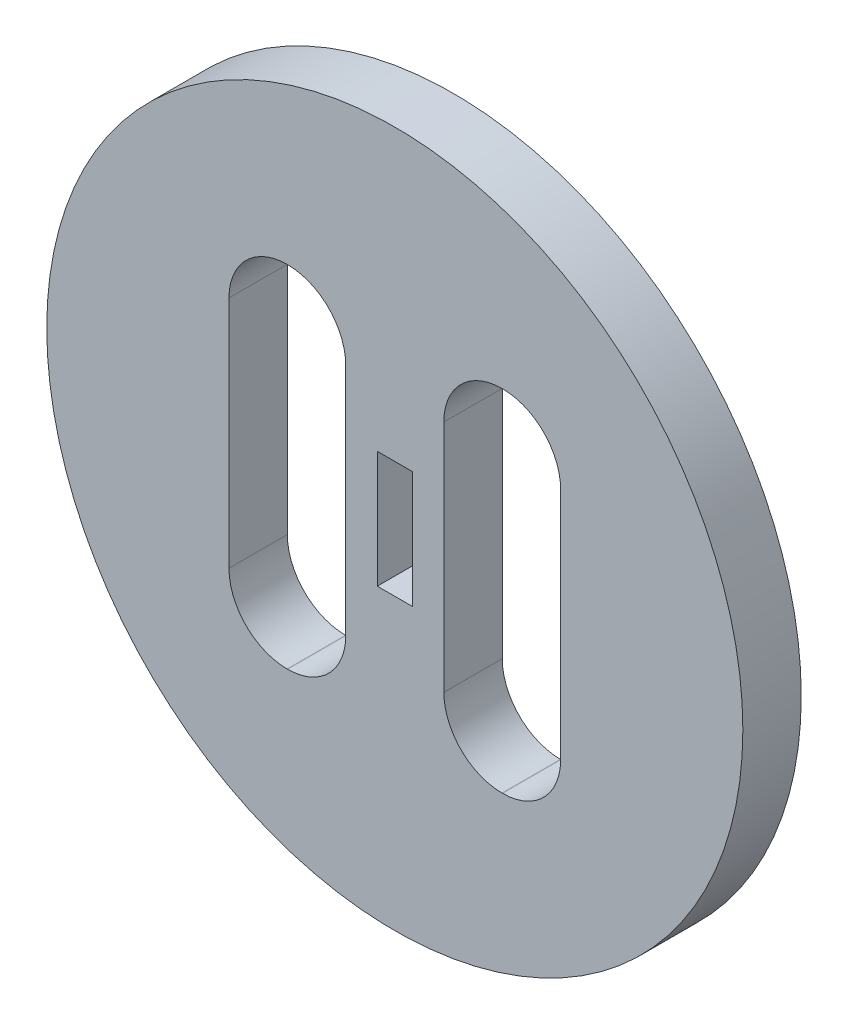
ISO-10303-21;
HEADER;
FILE_DESCRIPTION(('STEP AP214'),'2;1');
FILE_NAME('part.step','',(''),(''),'','','');
FILE_SCHEMA(('AUTOMOTIVE_DESIGN { 1 0 10303 214 1 1 1 1 }'));
ENDSEC;
DATA;
#1=APPLICATION_CONTEXT('core data for automotive mechanical design processes');
#2=APPLICATION_PROTOCOL_DEFINITION('international standard','automotive_design',2000,#1);
#3=PRODUCT_CONTEXT('',#1,'mechanical');
#4=PRODUCT('Part','Part','',(#3));
#5=PRODUCT_RELATED_PRODUCT_CATEGORY('part','',(#4));
#6=PRODUCT_DEFINITION_FORMATION('','',#4);
#7=PRODUCT_DEFINITION_CONTEXT('part definition',#1,'design');
#8=PRODUCT_DEFINITION('design','',#6,#7);
#9=PRODUCT_DEFINITION_SHAPE('','',#8);
#10=(LENGTH_UNIT() NAMED_UNIT(*) SI_UNIT(.MILLI.,.METRE.));
#11=(NAMED_UNIT(*) PLANE_ANGLE_UNIT() SI_UNIT($,.RADIAN.));
#12=(NAMED_UNIT(*) SI_UNIT($,.STERADIAN.) SOLID_ANGLE_UNIT());
#13=UNCERTAINTY_MEASURE_WITH_UNIT(LENGTH_MEASURE(1.E-05),#10,'distance_accuracy_value','');
#14=(GEOMETRIC_REPRESENTATION_CONTEXT(3) GLOBAL_UNCERTAINTY_ASSIGNED_CONTEXT((#13)) GLOBAL_UNIT_ASSIGNED_CONTEXT((#10,
#11,#12)) REPRESENTATION_CONTEXT('',''));
#15=CARTESIAN_POINT('',(0.,0.,0.));
#16=DIRECTION('',(0.,0.,1.));
#17=DIRECTION('',(1.,0.,0.));
#18=AXIS2_PLACEMENT_3D('',#15,#16,#17);
#19=CARTESIAN_POINT('',(0.,0.,6.35));
#20=DIRECTION('',(0.,0.,1.));
#21=DIRECTION('',(1.,0.,0.));
#22=AXIS2_PLACEMENT_3D('',#19,#20,#21);
#23=PLANE('',#22);
#24=DIRECTION('',(0.,-1.,0.));
#25=VECTOR('',#24,1.);
#26=CARTESIAN_POINT('',(5.334,12.7254,6.35));
#27=LINE('',#26,#25);
#28=CARTESIAN_POINT('',(5.334,12.7254,6.35));
#29=VERTEX_POINT('',#28);
#30=CARTESIAN_POINT('',(5.334,-12.7254,6.35));
#31=VERTEX_POINT('',#30);
#32=EDGE_CURVE('E229',#29,#31,#27,.T.);
#33=ORIENTED_EDGE('',*,*,#32,.F.);
#34=CARTESIAN_POINT('',(11.6586,12.7254,6.35));
#35=DIRECTION('',(0.,0.,1.));
#36=DIRECTION('',(-1.,0.,0.));
#37=AXIS2_PLACEMENT_3D('',#34,#35,#36);
#38=CIRCLE('',#37,6.3246);
#39=CARTESIAN_POINT('',(11.6586,19.05,6.35));
#40=VERTEX_POINT('',#39);
#41=EDGE_CURVE('E227',#40,#29,#38,.T.);
#42=ORIENTED_EDGE('',*,*,#41,.F.);
#43=DIRECTION('',(-1.,0.,0.));
#44=VECTOR('',#43,1.);
#45=CARTESIAN_POINT('',(11.6586,19.05,6.35));
#46=LINE('',#45,#44);
#47=CARTESIAN_POINT('',(11.7094,19.05,6.35));
#48=VERTEX_POINT('',#47);
#49=EDGE_CURVE('E242',#48,#40,#46,.T.);
#50=ORIENTED_EDGE('',*,*,#49,.F.);
#51=CARTESIAN_POINT('',(11.7094,12.7254,6.35));
#52=DIRECTION('',(0.,0.,1.));
#53=DIRECTION('',(1.,0.,0.));
#54=AXIS2_PLACEMENT_3D('',#51,#52,#53);
#55=CIRCLE('',#54,6.3246);
#56=CARTESIAN_POINT('',(18.034,12.7254,6.35));
#57=VERTEX_POINT('',#56);
#58=EDGE_CURVE('E239',#57,#48,#55,.T.);
#59=ORIENTED_EDGE('',*,*,#58,.F.);
#60=DIRECTION('',(0.,1.,0.));
#61=VECTOR('',#60,1.);
#62=CARTESIAN_POINT('',(18.034,12.7254,6.35));
#63=LINE('',#62,#61);
#64=CARTESIAN_POINT('',(18.034,-12.7254,6.35));
#65=VERTEX_POINT('',#64);
#66=EDGE_CURVE('E237',#65,#57,#63,.T.);
#67=ORIENTED_EDGE('',*,*,#66,.F.);
#68=CARTESIAN_POINT('',(11.7094,-12.7254,6.35));
#69=DIRECTION('',(0.,0.,1.));
#70=DIRECTION('',(1.,0.,0.));
#71=AXIS2_PLACEMENT_3D('',#68,#69,#70);
#72=CIRCLE('',#71,6.3246);
#73=CARTESIAN_POINT('',(11.7094,-19.05,6.35));
#74=VERTEX_POINT('',#73);
#75=EDGE_CURVE('E235',#74,#65,#72,.T.);
#76=ORIENTED_EDGE('',*,*,#75,.F.);
#77=DIRECTION('',(1.,0.,0.));
#78=VECTOR('',#77,1.);
#79=CARTESIAN_POINT('',(11.6586,-19.05,6.35));
#80=LINE('',#79,#78);
#81=CARTESIAN_POINT('',(11.6586,-19.05,6.35));
#82=VERTEX_POINT('',#81);
#83=EDGE_CURVE('E233',#82,#74,#80,.T.);
#84=ORIENTED_EDGE('',*,*,#83,.F.);
#85=CARTESIAN_POINT('',(11.6586,-12.7254,6.35));
#86=DIRECTION('',(0.,0.,1.));
#87=DIRECTION('',(1.,0.,0.));
#88=AXIS2_PLACEMENT_3D('',#85,#86,#87);
#89=CIRCLE('',#88,6.3246);
#90=EDGE_CURVE('E231',#31,#82,#89,.T.);
#91=ORIENTED_EDGE('',*,*,#90,.F.);
#92=EDGE_LOOP('',(#33,#42,#50,#59,#67,#76,#84,#91));
#93=FACE_BOUND('',#92,.T.);
#94=CARTESIAN_POINT('',(0.,0.,6.35));
#95=DIRECTION('',(0.,0.,1.));
#96=DIRECTION('',(1.,0.,0.));
#97=AXIS2_PLACEMENT_3D('',#94,#95,#96);
#98=CIRCLE('',#97,37.846);
#99=CARTESIAN_POINT('',(37.846,0.,6.35));
#100=VERTEX_POINT('',#99);
#101=EDGE_CURVE('E11',#100,#100,#98,.T.);
#102=ORIENTED_EDGE('',*,*,#101,.T.);
#103=EDGE_LOOP('',(#102));
#104=FACE_BOUND('',#103,.T.);
#105=DIRECTION('',(0.,-1.,0.));
#106=VECTOR('',#105,1.);
#107=CARTESIAN_POINT('',(-18.034,12.7254,6.35));
#108=LINE('',#107,#106);
#109=CARTESIAN_POINT('',(-18.034,12.7254,6.35));
#110=VERTEX_POINT('',#109);
#111=CARTESIAN_POINT('',(-18.034,-12.7254,6.35));
#112=VERTEX_POINT('',#111);
#113=EDGE_CURVE('E288',#110,#112,#108,.T.);
#114=ORIENTED_EDGE('',*,*,#113,.F.);
#115=CARTESIAN_POINT('',(-11.7094,12.7254,6.35));
#116=DIRECTION('',(0.,0.,1.));
#117=DIRECTION('',(-1.,0.,0.));
#118=AXIS2_PLACEMENT_3D('',#115,#116,#117);
#119=CIRCLE('',#118,6.3246);
#120=CARTESIAN_POINT('',(-11.7094,19.05,6.35));
#121=VERTEX_POINT('',#120);
#122=EDGE_CURVE('E286',#121,#110,#119,.T.);
#123=ORIENTED_EDGE('',*,*,#122,.F.);
#124=DIRECTION('',(-1.,0.,0.));
#125=VECTOR('',#124,1.);
#126=CARTESIAN_POINT('',(-11.7094,19.05,6.35));
#127=LINE('',#126,#125);
#128=CARTESIAN_POINT('',(-11.6586,19.05,6.35));
#129=VERTEX_POINT('',#128);
#130=EDGE_CURVE('E301',#129,#121,#127,.T.);
#131=ORIENTED_EDGE('',*,*,#130,.F.);
#132=CARTESIAN_POINT('',(-11.6586,12.7254,6.35));
#133=DIRECTION('',(0.,0.,1.));
#134=DIRECTION('',(1.,0.,0.));
#135=AXIS2_PLACEMENT_3D('',#132,#133,#134);
#136=CIRCLE('',#135,6.3246);
#137=CARTESIAN_POINT('',(-5.334,12.7254,6.35));
#138=VERTEX_POINT('',#137);
#139=EDGE_CURVE('E298',#138,#129,#136,.T.);
#140=ORIENTED_EDGE('',*,*,#139,.F.);
#141=DIRECTION('',(0.,1.,0.));
#142=VECTOR('',#141,1.);
#143=CARTESIAN_POINT('',(-5.334,12.7254,6.35));
#144=LINE('',#143,#142);
#145=CARTESIAN_POINT('',(-5.334,-12.7254,6.35));
#146=VERTEX_POINT('',#145);
#147=EDGE_CURVE('E296',#146,#138,#144,.T.);
#148=ORIENTED_EDGE('',*,*,#147,.F.);
#149=CARTESIAN_POINT('',(-11.6586,-12.7254,6.35));
#150=DIRECTION('',(0.,0.,1.));
#151=DIRECTION('',(1.,0.,0.));
#152=AXIS2_PLACEMENT_3D('',#149,#150,#151);
#153=CIRCLE('',#152,6.3246);
#154=CARTESIAN_POINT('',(-11.6586,-19.05,6.35));
#155=VERTEX_POINT('',#154);
#156=EDGE_CURVE('E294',#155,#146,#153,.T.);
#157=ORIENTED_EDGE('',*,*,#156,.F.);
#158=DIRECTION('',(1.,0.,0.));
#159=VECTOR('',#158,1.);
#160=CARTESIAN_POINT('',(-11.7094,-19.05,6.35));
#161=LINE('',#160,#159);
#162=CARTESIAN_POINT('',(-11.7094,-19.05,6.35));
#163=VERTEX_POINT('',#162);
#164=EDGE_CURVE('E292',#163,#155,#161,.T.);
#165=ORIENTED_EDGE('',*,*,#164,.F.);
#166=CARTESIAN_POINT('',(-11.7094,-12.7254,6.35));
#167=DIRECTION('',(0.,0.,1.));
#168=DIRECTION('',(-1.,0.,0.));
#169=AXIS2_PLACEMENT_3D('',#166,#167,#168);
#170=CIRCLE('',#169,6.3246);
#171=EDGE_CURVE('E290',#112,#163,#170,.T.);
#172=ORIENTED_EDGE('',*,*,#171,.F.);
#173=EDGE_LOOP('',(#114,#123,#131,#140,#148,#157,#165,#172));
#174=FACE_BOUND('',#173,.T.);
#175=DIRECTION('',(1.,0.,0.));
#176=VECTOR('',#175,1.);
#177=CARTESIAN_POINT('',(-1.905,-6.35,6.35));
#178=LINE('',#177,#176);
#179=CARTESIAN_POINT('',(-1.905,-6.35,6.35));
#180=VERTEX_POINT('',#179);
#181=CARTESIAN_POINT('',(1.905,-6.35,6.35));
#182=VERTEX_POINT('',#181);
#183=EDGE_CURVE('E194',#180,#182,#178,.T.);
#184=ORIENTED_EDGE('',*,*,#183,.F.);
#185=DIRECTION('',(0.,-1.,0.));
#186=VECTOR('',#185,1.);
#187=CARTESIAN_POINT('',(-1.905,6.35,6.35));
#188=LINE('',#187,#186);
#189=CARTESIAN_POINT('',(-1.905,6.35,6.35));
#190=VERTEX_POINT('',#189);
#191=EDGE_CURVE('E183',#190,#180,#188,.T.);
#192=ORIENTED_EDGE('',*,*,#191,.F.);
#193=DIRECTION('',(-1.,0.,0.));
#194=VECTOR('',#193,1.);
#195=CARTESIAN_POINT('',(-1.905,6.35,6.35));
#196=LINE('',#195,#194);
#197=CARTESIAN_POINT('',(1.905,6.35,6.35));
#198=VERTEX_POINT('',#197);
#199=EDGE_CURVE('E198',#198,#190,#196,.T.);
#200=ORIENTED_EDGE('',*,*,#199,.F.);
#201=DIRECTION('',(0.,1.,0.));
#202=VECTOR('',#201,1.);
#203=CARTESIAN_POINT('',(1.905,6.35,6.35));
#204=LINE('',#203,#202);
#205=EDGE_CURVE('E196',#182,#198,#204,.T.);
#206=ORIENTED_EDGE('',*,*,#205,.F.);
#207=EDGE_LOOP('',(#184,#192,#200,#206));
#208=FACE_BOUND('',#207,.T.);
#209=ADVANCED_FACE('F31',(#93,#104,#174,#208),#23,.T.);
#210=CARTESIAN_POINT('',(0.,0.,0.));
#211=DIRECTION('',(0.,0.,1.));
#212=DIRECTION('',(1.,0.,0.));
#213=AXIS2_PLACEMENT_3D('',#210,#211,#212);
#214=PLANE('',#213);
#215=CARTESIAN_POINT('',(11.6586,12.7254,0.));
#216=DIRECTION('',(0.,0.,1.));
#217=DIRECTION('',(-1.,0.,0.));
#218=AXIS2_PLACEMENT_3D('',#215,#216,#217);
#219=CIRCLE('',#218,6.3246);
#220=CARTESIAN_POINT('',(11.6586,19.05,0.));
#221=VERTEX_POINT('',#220);
#222=CARTESIAN_POINT('',(5.334,12.7254,0.));
#223=VERTEX_POINT('',#222);
#224=EDGE_CURVE('E184',#221,#223,#219,.T.);
#225=ORIENTED_EDGE('',*,*,#224,.T.);
#226=DIRECTION('',(0.,-1.,0.));
#227=VECTOR('',#226,1.);
#228=CARTESIAN_POINT('',(5.334,12.7254,0.));
#229=LINE('',#228,#227);
#230=CARTESIAN_POINT('',(5.334,-12.7254,0.));
#231=VERTEX_POINT('',#230);
#232=EDGE_CURVE('E206',#223,#231,#229,.T.);
#233=ORIENTED_EDGE('',*,*,#232,.T.);
#234=CARTESIAN_POINT('',(11.6586,-12.7254,0.));
#235=DIRECTION('',(0.,0.,1.));
#236=DIRECTION('',(1.,0.,0.));
#237=AXIS2_PLACEMENT_3D('',#234,#235,#236);
#238=CIRCLE('',#237,6.3246);
#239=CARTESIAN_POINT('',(11.6586,-19.05,0.));
#240=VERTEX_POINT('',#239);
#241=EDGE_CURVE('E209',#231,#240,#238,.T.);
#242=ORIENTED_EDGE('',*,*,#241,.T.);
#243=DIRECTION('',(1.,0.,0.));
#244=VECTOR('',#243,1.);
#245=CARTESIAN_POINT('',(11.6586,-19.05,0.));
#246=LINE('',#245,#244);
#247=CARTESIAN_POINT('',(11.7094,-19.05,0.));
#248=VERTEX_POINT('',#247);
#249=EDGE_CURVE('E212',#240,#248,#246,.T.);
#250=ORIENTED_EDGE('',*,*,#249,.T.);
#251=CARTESIAN_POINT('',(11.7094,-12.7254,0.));
#252=DIRECTION('',(0.,0.,1.));
#253=DIRECTION('',(1.,0.,0.));
#254=AXIS2_PLACEMENT_3D('',#251,#252,#253);
#255=CIRCLE('',#254,6.3246);
#256=CARTESIAN_POINT('',(18.034,-12.7254,0.));
#257=VERTEX_POINT('',#256);
#258=EDGE_CURVE('E215',#248,#257,#255,.T.);
#259=ORIENTED_EDGE('',*,*,#258,.T.);
#260=DIRECTION('',(0.,1.,0.));
#261=VECTOR('',#260,1.);
#262=CARTESIAN_POINT('',(18.034,12.7254,0.));
#263=LINE('',#262,#261);
#264=CARTESIAN_POINT('',(18.034,12.7254,0.));
#265=VERTEX_POINT('',#264);
#266=EDGE_CURVE('E218',#257,#265,#263,.T.);
#267=ORIENTED_EDGE('',*,*,#266,.T.);
#268=CARTESIAN_POINT('',(11.7094,12.7254,0.));
#269=DIRECTION('',(0.,0.,1.));
#270=DIRECTION('',(1.,0.,0.));
#271=AXIS2_PLACEMENT_3D('',#268,#269,#270);
#272=CIRCLE('',#271,6.3246);
#273=CARTESIAN_POINT('',(11.7094,19.05,0.));
#274=VERTEX_POINT('',#273);
#275=EDGE_CURVE('E221',#265,#274,#272,.T.);
#276=ORIENTED_EDGE('',*,*,#275,.T.);
#277=DIRECTION('',(-1.,0.,0.));
#278=VECTOR('',#277,1.);
#279=CARTESIAN_POINT('',(11.6586,19.05,0.));
#280=LINE('',#279,#278);
#281=EDGE_CURVE('E224',#274,#221,#280,.T.);
#282=ORIENTED_EDGE('',*,*,#281,.T.);
#283=EDGE_LOOP('',(#225,#233,#242,#250,#259,#267,#276,#282));
#284=FACE_BOUND('',#283,.T.);
#285=CARTESIAN_POINT('',(0.,0.,0.));
#286=DIRECTION('',(0.,0.,1.));
#287=DIRECTION('',(1.,0.,0.));
#288=AXIS2_PLACEMENT_3D('',#285,#286,#287);
#289=CIRCLE('',#288,37.846);
#290=CARTESIAN_POINT('',(37.846,0.,0.));
#291=VERTEX_POINT('',#290);
#292=EDGE_CURVE('E39',#291,#291,#289,.T.);
#293=ORIENTED_EDGE('',*,*,#292,.F.);
#294=EDGE_LOOP('',(#293));
#295=FACE_BOUND('',#294,.T.);
#296=CARTESIAN_POINT('',(-11.7094,12.7254,0.));
#297=DIRECTION('',(0.,0.,1.));
#298=DIRECTION('',(-1.,0.,0.));
#299=AXIS2_PLACEMENT_3D('',#296,#297,#298);
#300=CIRCLE('',#299,6.3246);
#301=CARTESIAN_POINT('',(-11.7094,19.05,0.));
#302=VERTEX_POINT('',#301);
#303=CARTESIAN_POINT('',(-18.034,12.7254,0.));
#304=VERTEX_POINT('',#303);
#305=EDGE_CURVE('E262',#302,#304,#300,.T.);
#306=ORIENTED_EDGE('',*,*,#305,.T.);
#307=DIRECTION('',(0.,-1.,0.));
#308=VECTOR('',#307,1.);
#309=CARTESIAN_POINT('',(-18.034,12.7254,0.));
#310=LINE('',#309,#308);
#311=CARTESIAN_POINT('',(-18.034,-12.7254,0.));
#312=VERTEX_POINT('',#311);
#313=EDGE_CURVE('E265',#304,#312,#310,.T.);
#314=ORIENTED_EDGE('',*,*,#313,.T.);
#315=CARTESIAN_POINT('',(-11.7094,-12.7254,0.));
#316=DIRECTION('',(0.,0.,1.));
#317=DIRECTION('',(-1.,0.,0.));
#318=AXIS2_PLACEMENT_3D('',#315,#316,#317);
#319=CIRCLE('',#318,6.3246);
#320=CARTESIAN_POINT('',(-11.7094,-19.05,0.));
#321=VERTEX_POINT('',#320);
#322=EDGE_CURVE('E268',#312,#321,#319,.T.);
#323=ORIENTED_EDGE('',*,*,#322,.T.);
#324=DIRECTION('',(1.,0.,0.));
#325=VECTOR('',#324,1.);
#326=CARTESIAN_POINT('',(-11.7094,-19.05,0.));
#327=LINE('',#326,#325);
#328=CARTESIAN_POINT('',(-11.6586,-19.05,0.));
#329=VERTEX_POINT('',#328);
#330=EDGE_CURVE('E271',#321,#329,#327,.T.);
#331=ORIENTED_EDGE('',*,*,#330,.T.);
#332=CARTESIAN_POINT('',(-11.6586,-12.7254,0.));
#333=DIRECTION('',(0.,0.,1.));
#334=DIRECTION('',(1.,0.,0.));
#335=AXIS2_PLACEMENT_3D('',#332,#333,#334);
#336=CIRCLE('',#335,6.3246);
#337=CARTESIAN_POINT('',(-5.334,-12.7254,0.));
#338=VERTEX_POINT('',#337);
#339=EDGE_CURVE('E274',#329,#338,#336,.T.);
#340=ORIENTED_EDGE('',*,*,#339,.T.);
#341=DIRECTION('',(0.,1.,0.));
#342=VECTOR('',#341,1.);
#343=CARTESIAN_POINT('',(-5.334,12.7254,0.));
#344=LINE('',#343,#342);
#345=CARTESIAN_POINT('',(-5.334,12.7254,0.));
#346=VERTEX_POINT('',#345);
#347=EDGE_CURVE('E277',#338,#346,#344,.T.);
#348=ORIENTED_EDGE('',*,*,#347,.T.);
#349=CARTESIAN_POINT('',(-11.6586,12.7254,0.));
#350=DIRECTION('',(0.,0.,1.));
#351=DIRECTION('',(1.,0.,0.));
#352=AXIS2_PLACEMENT_3D('',#349,#350,#351);
#353=CIRCLE('',#352,6.3246);
#354=CARTESIAN_POINT('',(-11.6586,19.05,0.));
#355=VERTEX_POINT('',#354);
#356=EDGE_CURVE('E280',#346,#355,#353,.T.);
#357=ORIENTED_EDGE('',*,*,#356,.T.);
#358=DIRECTION('',(-1.,0.,0.));
#359=VECTOR('',#358,1.);
#360=CARTESIAN_POINT('',(-11.7094,19.05,0.));
#361=LINE('',#360,#359);
#362=EDGE_CURVE('E283',#355,#302,#361,.T.);
#363=ORIENTED_EDGE('',*,*,#362,.T.);
#364=EDGE_LOOP('',(#306,#314,#323,#331,#340,#348,#357,#363));
#365=FACE_BOUND('',#364,.T.);
#366=DIRECTION('',(0.,-1.,0.));
#367=VECTOR('',#366,1.);
#368=CARTESIAN_POINT('',(-1.905,6.35,0.));
#369=LINE('',#368,#367);
#370=CARTESIAN_POINT('',(-1.905,6.35,0.));
#371=VERTEX_POINT('',#370);
#372=CARTESIAN_POINT('',(-1.905,-6.35,0.));
#373=VERTEX_POINT('',#372);
#374=EDGE_CURVE('E54',#371,#373,#369,.T.);
#375=ORIENTED_EDGE('',*,*,#374,.T.);
#376=DIRECTION('',(1.,0.,0.));
#377=VECTOR('',#376,1.);
#378=CARTESIAN_POINT('',(-1.905,-6.35,0.));
#379=LINE('',#378,#377);
#380=CARTESIAN_POINT('',(1.905,-6.35,0.));
#381=VERTEX_POINT('',#380);
#382=EDGE_CURVE('E170',#373,#381,#379,.T.);
#383=ORIENTED_EDGE('',*,*,#382,.T.);
#384=DIRECTION('',(0.,1.,0.));
#385=VECTOR('',#384,1.);
#386=CARTESIAN_POINT('',(1.905,6.35,0.));
#387=LINE('',#386,#385);
#388=CARTESIAN_POINT('',(1.905,6.35,0.));
#389=VERTEX_POINT('',#388);
#390=EDGE_CURVE('E179',#381,#389,#387,.T.);
#391=ORIENTED_EDGE('',*,*,#390,.T.);
#392=DIRECTION('',(-1.,0.,0.));
#393=VECTOR('',#392,1.);
#394=CARTESIAN_POINT('',(-1.905,6.35,0.));
#395=LINE('',#394,#393);
#396=EDGE_CURVE('E188',#389,#371,#395,.T.);
#397=ORIENTED_EDGE('',*,*,#396,.T.);
#398=EDGE_LOOP('',(#375,#383,#391,#397));
#399=FACE_BOUND('',#398,.T.);
#400=ADVANCED_FACE('F187',(#284,#295,#365,#399),#214,.F.);
#401=CARTESIAN_POINT('',(0.,0.,6.35));
#402=DIRECTION('',(0.,0.,-1.));
#403=DIRECTION('',(-1.,0.,0.));
#404=AXIS2_PLACEMENT_3D('',#401,#402,#403);
#405=CYLINDRICAL_SURFACE('',#404,37.846);
#406=ORIENTED_EDGE('',*,*,#101,.F.);
#407=EDGE_LOOP('',(#406));
#408=FACE_BOUND('',#407,.T.);
#409=ORIENTED_EDGE('',*,*,#292,.T.);
#410=EDGE_LOOP('',(#409));
#411=FACE_BOUND('',#410,.T.);
#412=ADVANCED_FACE('F33',(#408,#411),#405,.T.);
#413=CARTESIAN_POINT('',(-11.7094,12.7254,6.35));
#414=DIRECTION('',(0.,0.,-1.));
#415=DIRECTION('',(-1.,0.,0.));
#416=AXIS2_PLACEMENT_3D('',#413,#414,#415);
#417=CYLINDRICAL_SURFACE('',#416,6.3246);
#418=ORIENTED_EDGE('',*,*,#305,.F.);
#419=DIRECTION('',(0.,0.,-1.));
#420=VECTOR('',#419,1.);
#421=CARTESIAN_POINT('',(-11.7094,19.05,6.35));
#422=LINE('',#421,#420);
#423=EDGE_CURVE('E303',#121,#302,#422,.T.);
#424=ORIENTED_EDGE('',*,*,#423,.F.);
#425=ORIENTED_EDGE('',*,*,#122,.T.);
#426=DIRECTION('',(0.,0.,-1.));
#427=VECTOR('',#426,1.);
#428=CARTESIAN_POINT('',(-18.034,12.7254,6.35));
#429=LINE('',#428,#427);
#430=EDGE_CURVE('E318',#110,#304,#429,.T.);
#431=ORIENTED_EDGE('',*,*,#430,.T.);
#432=EDGE_LOOP('',(#418,#424,#425,#431));
#433=FACE_BOUND('',#432,.T.);
#434=ADVANCED_FACE('F331',(#433),#417,.F.);
#435=CARTESIAN_POINT('',(-18.034,12.7254,6.35));
#436=DIRECTION('',(1.,0.,0.));
#437=DIRECTION('',(0.,1.,0.));
#438=AXIS2_PLACEMENT_3D('',#435,#436,#437);
#439=PLANE('',#438);
#440=ORIENTED_EDGE('',*,*,#313,.F.);
#441=ORIENTED_EDGE('',*,*,#430,.F.);
#442=ORIENTED_EDGE('',*,*,#113,.T.);
#443=DIRECTION('',(0.,0.,-1.));
#444=VECTOR('',#443,1.);
#445=CARTESIAN_POINT('',(-18.034,-12.7254,6.35));
#446=LINE('',#445,#444);
#447=EDGE_CURVE('E316',#112,#312,#446,.T.);
#448=ORIENTED_EDGE('',*,*,#447,.T.);
#449=EDGE_LOOP('',(#440,#441,#442,#448));
#450=FACE_BOUND('',#449,.T.);
#451=ADVANCED_FACE('F344',(#450),#439,.T.);
#452=CARTESIAN_POINT('',(-11.7094,-12.7254,6.35));
#453=DIRECTION('',(0.,0.,-1.));
#454=DIRECTION('',(-1.,0.,0.));
#455=AXIS2_PLACEMENT_3D('',#452,#453,#454);
#456=CYLINDRICAL_SURFACE('',#455,6.3246);
#457=ORIENTED_EDGE('',*,*,#322,.F.);
#458=ORIENTED_EDGE('',*,*,#447,.F.);
#459=ORIENTED_EDGE('',*,*,#171,.T.);
#460=DIRECTION('',(0.,0.,-1.));
#461=VECTOR('',#460,1.);
#462=CARTESIAN_POINT('',(-11.7094,-19.05,6.35));
#463=LINE('',#462,#461);
#464=EDGE_CURVE('E314',#163,#321,#463,.T.);
#465=ORIENTED_EDGE('',*,*,#464,.T.);
#466=EDGE_LOOP('',(#457,#458,#459,#465));
#467=FACE_BOUND('',#466,.T.);
#468=ADVANCED_FACE('F348',(#467),#456,.F.);
#469=CARTESIAN_POINT('',(-11.7094,-19.05,6.35));
#470=DIRECTION('',(0.,1.,0.));
#471=DIRECTION('',(0.,0.,1.));
#472=AXIS2_PLACEMENT_3D('',#469,#470,#471);
#473=PLANE('',#472);
#474=ORIENTED_EDGE('',*,*,#330,.F.);
#475=ORIENTED_EDGE('',*,*,#464,.F.);
#476=ORIENTED_EDGE('',*,*,#164,.T.);
#477=DIRECTION('',(0.,0.,-1.));
#478=VECTOR('',#477,1.);
#479=CARTESIAN_POINT('',(-11.6586,-19.05,6.35));
#480=LINE('',#479,#478);
#481=EDGE_CURVE('E312',#155,#329,#480,.T.);
#482=ORIENTED_EDGE('',*,*,#481,.T.);
#483=EDGE_LOOP('',(#474,#475,#476,#482));
#484=FACE_BOUND('',#483,.T.);
#485=ADVANCED_FACE('F353',(#484),#473,.T.);
#486=CARTESIAN_POINT('',(-11.6586,-12.7254,6.35));
#487=DIRECTION('',(0.,0.,-1.));
#488=DIRECTION('',(-1.,0.,0.));
#489=AXIS2_PLACEMENT_3D('',#486,#487,#488);
#490=CYLINDRICAL_SURFACE('',#489,6.3246);
#491=ORIENTED_EDGE('',*,*,#339,.F.);
#492=ORIENTED_EDGE('',*,*,#481,.F.);
#493=ORIENTED_EDGE('',*,*,#156,.T.);
#494=DIRECTION('',(0.,0.,-1.));
#495=VECTOR('',#494,1.);
#496=CARTESIAN_POINT('',(-5.334,-12.7254,6.35));
#497=LINE('',#496,#495);
#498=EDGE_CURVE('E310',#146,#338,#497,.T.);
#499=ORIENTED_EDGE('',*,*,#498,.T.);
#500=EDGE_LOOP('',(#491,#492,#493,#499));
#501=FACE_BOUND('',#500,.T.);
#502=ADVANCED_FACE('F358',(#501),#490,.F.);
#503=CARTESIAN_POINT('',(-5.334,12.7254,6.35));
#504=DIRECTION('',(-1.,0.,0.));
#505=DIRECTION('',(0.,-1.,0.));
#506=AXIS2_PLACEMENT_3D('',#503,#504,#505);
#507=PLANE('',#506);
#508=ORIENTED_EDGE('',*,*,#347,.F.);
#509=ORIENTED_EDGE('',*,*,#498,.F.);
#510=ORIENTED_EDGE('',*,*,#147,.T.);
#511=DIRECTION('',(0.,0.,-1.));
#512=VECTOR('',#511,1.);
#513=CARTESIAN_POINT('',(-5.334,12.7254,6.35));
#514=LINE('',#513,#512);
#515=EDGE_CURVE('E308',#138,#346,#514,.T.);
#516=ORIENTED_EDGE('',*,*,#515,.T.);
#517=EDGE_LOOP('',(#508,#509,#510,#516));
#518=FACE_BOUND('',#517,.T.);
#519=ADVANCED_FACE('F362',(#518),#507,.T.);
#520=CARTESIAN_POINT('',(-11.6586,12.7254,6.35));
#521=DIRECTION('',(0.,0.,-1.));
#522=DIRECTION('',(-1.,0.,0.));
#523=AXIS2_PLACEMENT_3D('',#520,#521,#522);
#524=CYLINDRICAL_SURFACE('',#523,6.3246);
#525=ORIENTED_EDGE('',*,*,#356,.F.);
#526=ORIENTED_EDGE('',*,*,#515,.F.);
#527=ORIENTED_EDGE('',*,*,#139,.T.);
#528=DIRECTION('',(0.,0.,-1.));
#529=VECTOR('',#528,1.);
#530=CARTESIAN_POINT('',(-11.6586,19.05,6.35));
#531=LINE('',#530,#529);
#532=EDGE_CURVE('E306',#129,#355,#531,.T.);
#533=ORIENTED_EDGE('',*,*,#532,.T.);
#534=EDGE_LOOP('',(#525,#526,#527,#533));
#535=FACE_BOUND('',#534,.T.);
#536=ADVANCED_FACE('F366',(#535),#524,.F.);
#537=CARTESIAN_POINT('',(-11.7094,19.05,6.35));
#538=DIRECTION('',(0.,-1.,0.));
#539=DIRECTION('',(0.,0.,-1.));
#540=AXIS2_PLACEMENT_3D('',#537,#538,#539);
#541=PLANE('',#540);
#542=ORIENTED_EDGE('',*,*,#362,.F.);
#543=ORIENTED_EDGE('',*,*,#532,.F.);
#544=ORIENTED_EDGE('',*,*,#130,.T.);
#545=ORIENTED_EDGE('',*,*,#423,.T.);
#546=EDGE_LOOP('',(#542,#543,#544,#545));
#547=FACE_BOUND('',#546,.T.);
#548=ADVANCED_FACE('F335',(#547),#541,.T.);
#549=CARTESIAN_POINT('',(11.6586,12.7254,6.35));
#550=DIRECTION('',(0.,0.,-1.));
#551=DIRECTION('',(-1.,0.,0.));
#552=AXIS2_PLACEMENT_3D('',#549,#550,#551);
#553=CYLINDRICAL_SURFACE('',#552,6.3246);
#554=ORIENTED_EDGE('',*,*,#224,.F.);
#555=DIRECTION('',(0.,0.,-1.));
#556=VECTOR('',#555,1.);
#557=CARTESIAN_POINT('',(11.6586,19.05,6.35));
#558=LINE('',#557,#556);
#559=EDGE_CURVE('E244',#40,#221,#558,.T.);
#560=ORIENTED_EDGE('',*,*,#559,.F.);
#561=ORIENTED_EDGE('',*,*,#41,.T.);
#562=DIRECTION('',(0.,0.,-1.));
#563=VECTOR('',#562,1.);
#564=CARTESIAN_POINT('',(5.334,12.7254,6.35));
#565=LINE('',#564,#563);
#566=EDGE_CURVE('E259',#29,#223,#565,.T.);
#567=ORIENTED_EDGE('',*,*,#566,.T.);
#568=EDGE_LOOP('',(#554,#560,#561,#567));
#569=FACE_BOUND('',#568,.T.);
#570=ADVANCED_FACE('F373',(#569),#553,.F.);
#571=CARTESIAN_POINT('',(5.334,12.7254,6.35));
#572=DIRECTION('',(1.,0.,0.));
#573=DIRECTION('',(0.,1.,0.));
#574=AXIS2_PLACEMENT_3D('',#571,#572,#573);
#575=PLANE('',#574);
#576=ORIENTED_EDGE('',*,*,#232,.F.);
#577=ORIENTED_EDGE('',*,*,#566,.F.);
#578=ORIENTED_EDGE('',*,*,#32,.T.);
#579=DIRECTION('',(0.,0.,-1.));
#580=VECTOR('',#579,1.);
#581=CARTESIAN_POINT('',(5.334,-12.7254,6.35));
#582=LINE('',#581,#580);
#583=EDGE_CURVE('E257',#31,#231,#582,.T.);
#584=ORIENTED_EDGE('',*,*,#583,.T.);
#585=EDGE_LOOP('',(#576,#577,#578,#584));
#586=FACE_BOUND('',#585,.T.);
#587=ADVANCED_FACE('F419',(#586),#575,.T.);
#588=CARTESIAN_POINT('',(11.6586,-12.7254,6.35));
#589=DIRECTION('',(0.,0.,-1.));
#590=DIRECTION('',(-1.,0.,0.));
#591=AXIS2_PLACEMENT_3D('',#588,#589,#590);
#592=CYLINDRICAL_SURFACE('',#591,6.3246);
#593=ORIENTED_EDGE('',*,*,#241,.F.);
#594=ORIENTED_EDGE('',*,*,#583,.F.);
#595=ORIENTED_EDGE('',*,*,#90,.T.);
#596=DIRECTION('',(0.,0.,-1.));
#597=VECTOR('',#596,1.);
#598=CARTESIAN_POINT('',(11.6586,-19.05,6.35));
#599=LINE('',#598,#597);
#600=EDGE_CURVE('E255',#82,#240,#599,.T.);
#601=ORIENTED_EDGE('',*,*,#600,.T.);
#602=EDGE_LOOP('',(#593,#594,#595,#601));
#603=FACE_BOUND('',#602,.T.);
#604=ADVANCED_FACE('F429',(#603),#592,.F.);
#605=CARTESIAN_POINT('',(11.6586,-19.05,6.35));
#606=DIRECTION('',(0.,1.,0.));
#607=DIRECTION('',(0.,0.,1.));
#608=AXIS2_PLACEMENT_3D('',#605,#606,#607);
#609=PLANE('',#608);
#610=ORIENTED_EDGE('',*,*,#249,.F.);
#611=ORIENTED_EDGE('',*,*,#600,.F.);
#612=ORIENTED_EDGE('',*,*,#83,.T.);
#613=DIRECTION('',(0.,0.,-1.));
#614=VECTOR('',#613,1.);
#615=CARTESIAN_POINT('',(11.7094,-19.05,6.35));
#616=LINE('',#615,#614);
#617=EDGE_CURVE('E253',#74,#248,#616,.T.);
#618=ORIENTED_EDGE('',*,*,#617,.T.);
#619=EDGE_LOOP('',(#610,#611,#612,#618));
#620=FACE_BOUND('',#619,.T.);
#621=ADVANCED_FACE('F439',(#620),#609,.T.);
#622=CARTESIAN_POINT('',(11.7094,-12.7254,6.35));
#623=DIRECTION('',(0.,0.,-1.));
#624=DIRECTION('',(-1.,0.,0.));
#625=AXIS2_PLACEMENT_3D('',#622,#623,#624);
#626=CYLINDRICAL_SURFACE('',#625,6.3246);
#627=ORIENTED_EDGE('',*,*,#258,.F.);
#628=ORIENTED_EDGE('',*,*,#617,.F.);
#629=ORIENTED_EDGE('',*,*,#75,.T.);
#630=DIRECTION('',(0.,0.,-1.));
#631=VECTOR('',#630,1.);
#632=CARTESIAN_POINT('',(18.034,-12.7254,6.35));
#633=LINE('',#632,#631);
#634=EDGE_CURVE('E251',#65,#257,#633,.T.);
#635=ORIENTED_EDGE('',*,*,#634,.T.);
#636=EDGE_LOOP('',(#627,#628,#629,#635));
#637=FACE_BOUND('',#636,.T.);
#638=ADVANCED_FACE('F449',(#637),#626,.F.);
#639=CARTESIAN_POINT('',(18.034,12.7254,6.35));
#640=DIRECTION('',(-1.,0.,0.));
#641=DIRECTION('',(0.,-1.,0.));
#642=AXIS2_PLACEMENT_3D('',#639,#640,#641);
#643=PLANE('',#642);
#644=ORIENTED_EDGE('',*,*,#266,.F.);
#645=ORIENTED_EDGE('',*,*,#634,.F.);
#646=ORIENTED_EDGE('',*,*,#66,.T.);
#647=DIRECTION('',(0.,0.,-1.));
#648=VECTOR('',#647,1.);
#649=CARTESIAN_POINT('',(18.034,12.7254,6.35));
#650=LINE('',#649,#648);
#651=EDGE_CURVE('E249',#57,#265,#650,.T.);
#652=ORIENTED_EDGE('',*,*,#651,.T.);
#653=EDGE_LOOP('',(#644,#645,#646,#652));
#654=FACE_BOUND('',#653,.T.);
#655=ADVANCED_FACE('F459',(#654),#643,.T.);
#656=CARTESIAN_POINT('',(11.7094,12.7254,6.35));
#657=DIRECTION('',(0.,0.,-1.));
#658=DIRECTION('',(-1.,0.,0.));
#659=AXIS2_PLACEMENT_3D('',#656,#657,#658);
#660=CYLINDRICAL_SURFACE('',#659,6.3246);
#661=ORIENTED_EDGE('',*,*,#275,.F.);
#662=ORIENTED_EDGE('',*,*,#651,.F.);
#663=ORIENTED_EDGE('',*,*,#58,.T.);
#664=DIRECTION('',(0.,0.,-1.));
#665=VECTOR('',#664,1.);
#666=CARTESIAN_POINT('',(11.7094,19.05,6.35));
#667=LINE('',#666,#665);
#668=EDGE_CURVE('E247',#48,#274,#667,.T.);
#669=ORIENTED_EDGE('',*,*,#668,.T.);
#670=EDGE_LOOP('',(#661,#662,#663,#669));
#671=FACE_BOUND('',#670,.T.);
#672=ADVANCED_FACE('F469',(#671),#660,.F.);
#673=CARTESIAN_POINT('',(11.6586,19.05,6.35));
#674=DIRECTION('',(0.,-1.,0.));
#675=DIRECTION('',(0.,0.,-1.));
#676=AXIS2_PLACEMENT_3D('',#673,#674,#675);
#677=PLANE('',#676);
#678=ORIENTED_EDGE('',*,*,#281,.F.);
#679=ORIENTED_EDGE('',*,*,#668,.F.);
#680=ORIENTED_EDGE('',*,*,#49,.T.);
#681=ORIENTED_EDGE('',*,*,#559,.T.);
#682=EDGE_LOOP('',(#678,#679,#680,#681));
#683=FACE_BOUND('',#682,.T.);
#684=ADVANCED_FACE('F479',(#683),#677,.T.);
#685=CARTESIAN_POINT('',(-1.905,6.35,6.35));
#686=DIRECTION('',(1.,0.,0.));
#687=DIRECTION('',(0.,1.,0.));
#688=AXIS2_PLACEMENT_3D('',#685,#686,#687);
#689=PLANE('',#688);
#690=ORIENTED_EDGE('',*,*,#374,.F.);
#691=DIRECTION('',(0.,0.,-1.));
#692=VECTOR('',#691,1.);
#693=CARTESIAN_POINT('',(-1.905,6.35,6.35));
#694=LINE('',#693,#692);
#695=EDGE_CURVE('E200',#190,#371,#694,.T.);
#696=ORIENTED_EDGE('',*,*,#695,.F.);
#697=ORIENTED_EDGE('',*,*,#191,.T.);
#698=DIRECTION('',(0.,0.,-1.));
#699=VECTOR('',#698,1.);
#700=CARTESIAN_POINT('',(-1.905,-6.35,6.35));
#701=LINE('',#700,#699);
#702=EDGE_CURVE('E172',#180,#373,#701,.T.);
#703=ORIENTED_EDGE('',*,*,#702,.T.);
#704=EDGE_LOOP('',(#690,#696,#697,#703));
#705=FACE_BOUND('',#704,.T.);
#706=ADVANCED_FACE('F181',(#705),#689,.T.);
#707=CARTESIAN_POINT('',(-1.905,-6.35,6.35));
#708=DIRECTION('',(0.,1.,0.));
#709=DIRECTION('',(0.,0.,1.));
#710=AXIS2_PLACEMENT_3D('',#707,#708,#709);
#711=PLANE('',#710);
#712=ORIENTED_EDGE('',*,*,#382,.F.);
#713=ORIENTED_EDGE('',*,*,#702,.F.);
#714=ORIENTED_EDGE('',*,*,#183,.T.);
#715=DIRECTION('',(0.,0.,-1.));
#716=VECTOR('',#715,1.);
#717=CARTESIAN_POINT('',(1.905,-6.35,6.35));
#718=LINE('',#717,#716);
#719=EDGE_CURVE('E175',#182,#381,#718,.T.);
#720=ORIENTED_EDGE('',*,*,#719,.T.);
#721=EDGE_LOOP('',(#712,#713,#714,#720));
#722=FACE_BOUND('',#721,.T.);
#723=ADVANCED_FACE('F171',(#722),#711,.T.);
#724=CARTESIAN_POINT('',(1.905,6.35,6.35));
#725=DIRECTION('',(-1.,0.,0.));
#726=DIRECTION('',(0.,-1.,0.));
#727=AXIS2_PLACEMENT_3D('',#724,#725,#726);
#728=PLANE('',#727);
#729=ORIENTED_EDGE('',*,*,#390,.F.);
#730=ORIENTED_EDGE('',*,*,#719,.F.);
#731=ORIENTED_EDGE('',*,*,#205,.T.);
#732=DIRECTION('',(0.,0.,-1.));
#733=VECTOR('',#732,1.);
#734=CARTESIAN_POINT('',(1.905,6.35,6.35));
#735=LINE('',#734,#733);
#736=EDGE_CURVE('E46',#198,#389,#735,.T.);
#737=ORIENTED_EDGE('',*,*,#736,.T.);
#738=EDGE_LOOP('',(#729,#730,#731,#737));
#739=FACE_BOUND('',#738,.T.);
#740=ADVANCED_FACE('F517',(#739),#728,.T.);
#741=CARTESIAN_POINT('',(-1.905,6.35,6.35));
#742=DIRECTION('',(0.,-1.,0.));
#743=DIRECTION('',(1.,0.,0.));
#744=AXIS2_PLACEMENT_3D('',#741,#742,#743);
#745=PLANE('',#744);
#746=ORIENTED_EDGE('',*,*,#396,.F.);
#747=ORIENTED_EDGE('',*,*,#736,.F.);
#748=ORIENTED_EDGE('',*,*,#199,.T.);
#749=ORIENTED_EDGE('',*,*,#695,.T.);
#750=EDGE_LOOP('',(#746,#747,#748,#749));
#751=FACE_BOUND('',#750,.T.);
#752=ADVANCED_FACE('F526',(#751),#745,.T.);
#753=CLOSED_SHELL('',(#209,#400,#412,#434,#451,#468,#485,#502,#519,#536,#548,#570,#587,#604,
#621,#638,#655,#672,#684,#706,#723,#740,#752));
#754=MANIFOLD_SOLID_BREP('B2',#753);
#755=ADVANCED_BREP_SHAPE_REPRESENTATION('',(#18,#754),#14);
#756=SHAPE_DEFINITION_REPRESENTATION(#9,#755);
ENDSEC;
END-ISO-10303-21;
